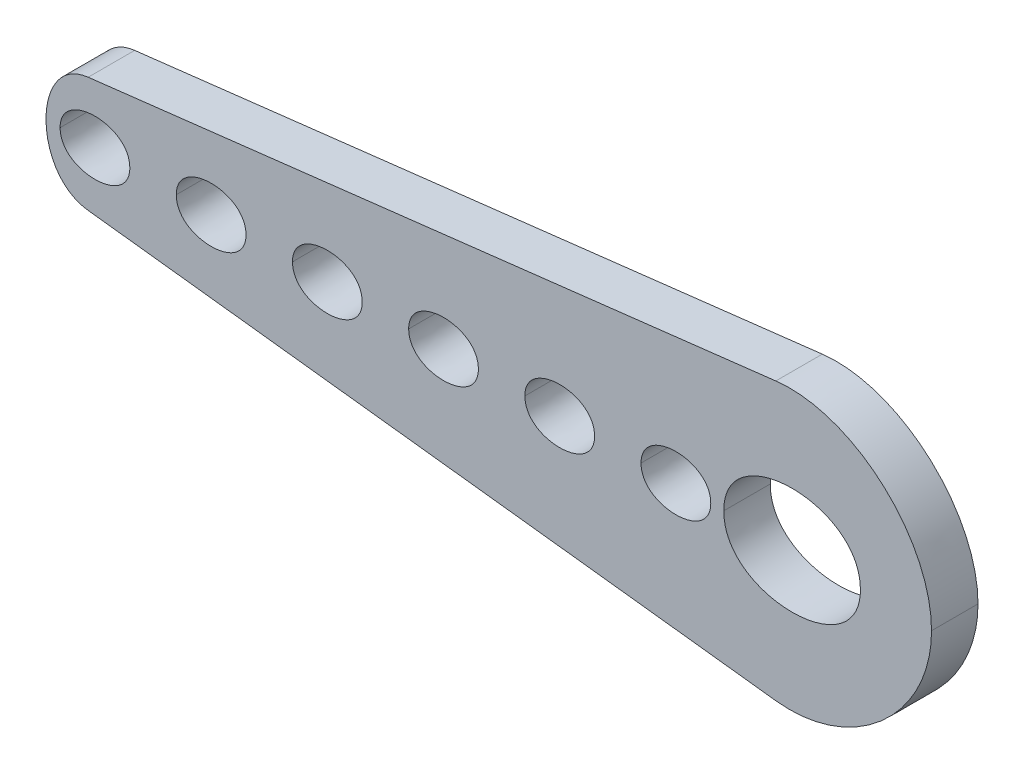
from build123d import *

# Parameters (mm, degrees)
BOSS_EXTRUDE1_DEPTH = 2


with BuildPart() as part:
    # Sketch1 → Boss-Extrude1 (new body)
    with BuildSketch(Plane.XY.offset(2)):
        with BuildLine():
            add(Edge.make_bspline(
                [(27.521365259, -5.959026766), (30.88894486, -6.354320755), (34.221468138, -3.32435911), (34.221354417, 0)],
                knots=[0, 0, 0, 0, 1, 1, 1, 1], degree=3))
            add(Edge.make_bspline(
                [(34.221354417, 0), (34.221230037, 3.328098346), (30.891057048, 6.354568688), (27.521365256, 5.959026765)],
                knots=[0, 0, 0, 0, 1, 1, 1, 1], degree=3))
            add(Edge.make_bspline(
                [(27.521365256, 5.959026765), (17.657459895, 4.800337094), (7.793547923, 3.641692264), (-2.070300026, 2.482916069)],
                knots=[0, 0, 0, 0, 1, 1, 1, 1], degree=3))
            add(Edge.make_bspline(
                [(-2.070300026, 2.482916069), (-4.494346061, 2.19810123), (-4.487329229, -2.198953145), (-2.070300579, -2.482920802)],
                knots=[0, 0, 0, 0, 1, 1, 1, 1], degree=3))
            add(Edge.make_bspline(
                [(-2.070300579, -2.482920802), (7.79356409, -3.641666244), (17.657466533, -4.800333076), (27.521365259, -5.959026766)],
                knots=[0, 0, 0, 0, 1, 1, 1, 1], degree=3))
        make_face()
        with BuildLine():
            add(Edge.make_bspline(
                [(25.281365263, 0), (25.281365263, -3.078760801), (31.161365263, -3.078760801), (31.161365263, 0)],
                knots=[0, 0, 0, 0, 1, 1, 1, 1], degree=3))
            add(Edge.make_bspline(
                [(31.161365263, 0), (31.161365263, 3.078760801), (25.281365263, 3.078760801), (25.281365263, 0)],
                knots=[0, 0, 0, 0, 1, 1, 1, 1], degree=3))
        make_face(mode=Mode.SUBTRACT)
        with BuildLine():
            add(Edge.make_bspline(
                [(21.721365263, 0), (21.721365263, -1.570796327), (24.721365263, -1.570796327), (24.721365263, 0)],
                knots=[0, 0, 0, 0, 1, 1, 1, 1], degree=3))
            add(Edge.make_bspline(
                [(24.721365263, 0), (24.721365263, 1.570796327), (21.721365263, 1.570796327), (21.721365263, 0)],
                knots=[0, 0, 0, 0, 1, 1, 1, 1], degree=3))
        make_face(mode=Mode.SUBTRACT)
        with BuildLine():
            add(Edge.make_bspline(
                [(16.721365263, 0), (16.721365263, -1.570796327), (19.721365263, -1.570796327), (19.721365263, 0)],
                knots=[0, 0, 0, 0, 1, 1, 1, 1], degree=3))
            add(Edge.make_bspline(
                [(19.721365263, 0), (19.721365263, 1.570796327), (16.721365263, 1.570796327), (16.721365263, 0)],
                knots=[0, 0, 0, 0, 1, 1, 1, 1], degree=3))
        make_face(mode=Mode.SUBTRACT)
        with BuildLine():
            add(Edge.make_bspline(
                [(11.721365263, 0), (11.721365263, -1.570796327), (14.721365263, -1.570796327), (14.721365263, 0)],
                knots=[0, 0, 0, 0, 1, 1, 1, 1], degree=3))
            add(Edge.make_bspline(
                [(14.721365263, 0), (14.721365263, 1.570796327), (11.721365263, 1.570796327), (11.721365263, 0)],
                knots=[0, 0, 0, 0, 1, 1, 1, 1], degree=3))
        make_face(mode=Mode.SUBTRACT)
        with BuildLine():
            add(Edge.make_bspline(
                [(-3.278634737, 0), (-3.278634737, -1.570796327), (-0.278634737, -1.570796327), (-0.278634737, 0)],
                knots=[0, 0, 0, 0, 1, 1, 1, 1], degree=3))
            add(Edge.make_bspline(
                [(-0.278634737, 0), (-0.278634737, 1.570796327), (-3.278634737, 1.570796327), (-3.278634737, 0)],
                knots=[0, 0, 0, 0, 1, 1, 1, 1], degree=3))
        make_face(mode=Mode.SUBTRACT)
        with BuildLine():
            add(Edge.make_bspline(
                [(1.721365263, 0), (1.721365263, -1.570796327), (4.721365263, -1.570796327), (4.721365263, 0)],
                knots=[0, 0, 0, 0, 1, 1, 1, 1], degree=3))
            add(Edge.make_bspline(
                [(4.721365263, 0), (4.721365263, 1.570796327), (1.721365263, 1.570796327), (1.721365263, 0)],
                knots=[0, 0, 0, 0, 1, 1, 1, 1], degree=3))
        make_face(mode=Mode.SUBTRACT)
        with BuildLine():
            add(Edge.make_bspline(
                [(6.721365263, 0), (6.721365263, -1.570796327), (9.721365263, -1.570796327), (9.721365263, 0)],
                knots=[0, 0, 0, 0, 1, 1, 1, 1], degree=3))
            add(Edge.make_bspline(
                [(9.721365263, 0), (9.721365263, 1.570796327), (6.721365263, 1.570796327), (6.721365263, 0)],
                knots=[0, 0, 0, 0, 1, 1, 1, 1], degree=3))
        make_face(mode=Mode.SUBTRACT)
    extrude(amount=-BOSS_EXTRUDE1_DEPTH)


solid = part.part
